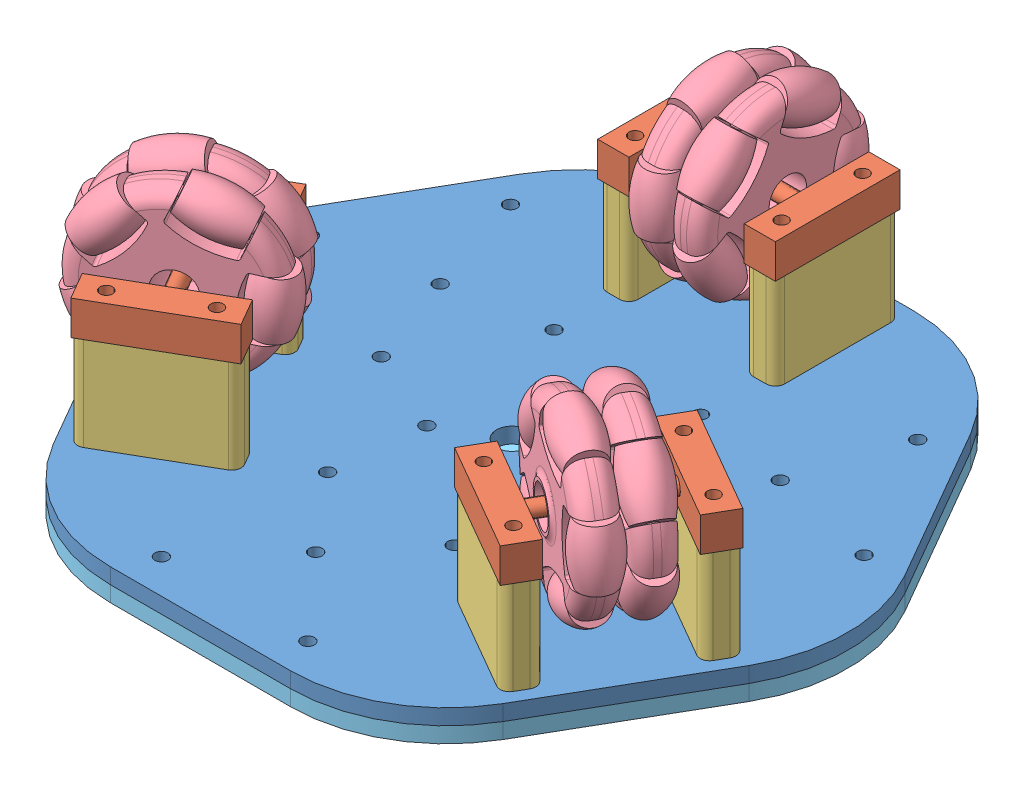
SolidWorks assembly 装配体-底座.SLDASM, configuration 默认 (file format 12000). Lengths in mm.
Overall size (280.94 77 286.6).
17 component instances, 5 part files, 12 mates.
Components (placement in the parent):
- 底盘-上层-1: 底盘-上层.SLDPRT [默认] at (-27.1025 -44.7578 215.4701) size (215.47 5 200)
- 装配体-支撑腿-1: 装配体-支撑腿.SLDASM [默认] at (-67.1097 -11.8387 183.0428) x (0.072827 0.996458 -0.042047) z (-0.862958 0.084094 0.498229) size (66.21 57 58.3)
  - 全向轮固定架-1: 全向轮固定架.SLDPRT [默认] at (-12.0465 -19.5864 36.6833) x (0 -1 0) z (-0.084094 0 0.996458) size (57 11 40)
  - 万向轮支撑腿-分体式-1: 万向轮支撑腿-分体式.SLDPRT [默认] at (-30.9792 -29.5864 35.0855) x (0 -1 0) z (-0.084094 0 0.996458) size (10 30 40)
  - 万向轮支撑腿-分体式-2: 万向轮支撑腿-分体式.SLDPRT [默认] at (-30.9792 -76.5864 35.0855) x (0 -1 0) z (-0.084094 0 0.996458) size (10 30 40)
  - 全向轮-网上找的模型58mm-1: 全向轮-网上找的模型58mm.SLDPRT [По умолчанию] at (2.7132 -35.5864 58) x (1 0 0) z (0 -1 0) size (58.3 58.3 27)
- 装配体-支撑腿-2: 装配体-支撑腿.SLDASM [默认] at (-35.1817 -11.8387 266.3309) x (-0.072827 0.996458 -0.042047) z (0.862958 0.084094 0.498229) size (66.21 57 58.3)
  - 全向轮固定架-1: 全向轮固定架.SLDPRT [默认] at (-12.0465 -19.5864 36.6833) x (0 -1 0) z (-0.084094 0 0.996458) size (57 11 40)
  - 万向轮支撑腿-分体式-1: 万向轮支撑腿-分体式.SLDPRT [默认] at (-30.9792 -29.5864 35.0855) x (0 -1 0) z (-0.084094 0 0.996458) size (10 30 40)
  - 万向轮支撑腿-分体式-2: 万向轮支撑腿-分体式.SLDPRT [默认] at (-30.9792 -76.5864 35.0855) x (0 -1 0) z (-0.084094 0 0.996458) size (10 30 40)
  - 全向轮-网上找的模型58mm-1: 全向轮-网上找的模型58mm.SLDPRT [По умолчанию] at (2.7132 -35.5864 58) x (1 0 0) z (0 -1 0) size (58.3 58.3 27)
- 装配体-支撑腿-3: 装配体-支撑腿.SLDASM [默认] at (-75.1889 -11.8387 81.9037) x (0 0.996458 -0.084094) z (0 0.084094 0.996458) size (66.21 57 58.3)
  - 全向轮固定架-1: 全向轮固定架.SLDPRT [默认] at (-12.0465 -19.5864 36.6833) x (0 -1 0) z (-0.084094 0 0.996458) size (57 11 40)
  - 万向轮支撑腿-分体式-1: 万向轮支撑腿-分体式.SLDPRT [默认] at (-30.9792 -29.5864 35.0855) x (0 -1 0) z (-0.084094 0 0.996458) size (10 30 40)
  - 万向轮支撑腿-分体式-2: 万向轮支撑腿-分体式.SLDPRT [默认] at (-30.9792 -76.5864 35.0855) x (0 -1 0) z (-0.084094 0 0.996458) size (10 30 40)
  - 全向轮-网上找的模型58mm-1: 全向轮-网上找的模型58mm.SLDPRT [По умолчанию] at (2.7132 -35.5864 58) x (1 0 0) z (0 -1 0) size (58.3 58.3 27)
- 底盘-下层-1: 底盘-下层.SLDPRT [默认] at (-27.1025 -49.7578 215.4701) x (-0.5 0 -0.866025) z (0.866025 0 -0.5) size (215.47 5 200)
Mates (geometry in assembly coordinates):
- 重合1: coincident anti-aligned: plane of 底盘-上层-1 through (-27.1025 -39.7578 215.4701) normal (0 1 0); plane of 装配体-支撑腿-1/万向轮支撑腿-分体式-2 through (-61.3499 -39.7578 268.1518) normal (0 -1 0)
- 重合2: coincident anti-aligned: plane of 底盘-上层-1 through (-27.1025 -39.7578 215.4701) normal (0 1 0); plane of 装配体-支撑腿-2/万向轮支撑腿-分体式-1 through (12.145 -39.7578 259.4915) normal (0 -1 0)
- 重合3: coincident anti-aligned: plane of 底盘-上层-1 through (-27.1025 -39.7578 215.4701) normal (0 1 0); plane of 装配体-支撑腿-3/万向轮支撑腿-分体式-2 through (1.3975 -39.7578 119.4701) normal (0 -1 0)
- 重合4: coincident anti-aligned: plane of 底盘-上层-1 through (-27.1025 -44.7578 215.4701) normal (0 -1 0); plane of 底盘-下层-1 through (-27.1025 -44.7578 215.4701) normal (0 1 0)
- 同心14: concentric aligned: cylinder of 底盘-上层-1 through (38.2238 -44.7578 280.3217) axis (0 1 0) radius 2.1; cylinder of 底盘-下层-1 through (38.2238 -49.7578 280.3217) axis (0 1 0) radius 4
- 同心15: concentric aligned: cylinder of 底盘-上层-1 through (61.7238 -44.7578 239.6185) axis (0 1 0) radius 2.1; cylinder of 底盘-下层-1 through (61.7238 -49.7578 239.6185) axis (0 1 0) radius 4
- 同心16: concentric anti-aligned: cylinder of 装配体-支撑腿-1/万向轮支撑腿-分体式-2 through (-92.4287 -9.7578 280.3217) axis (0 -1 0) radius 2.1; cylinder of 底盘-下层-1 through (-92.4287 -49.7578 280.3217) axis (0 1 0) radius 4
- 同心17: concentric anti-aligned: cylinder of 装配体-支撑腿-1/万向轮支撑腿-分体式-1 through (-115.9287 -9.7578 239.6185) axis (0 -1 0) radius 2.1; cylinder of 底盘-下层-1 through (-115.9287 -49.7578 239.6185) axis (0 1 0) radius 4
- 同心18: concentric anti-aligned: cylinder of 装配体-支撑腿-3/万向轮支撑腿-分体式-1 through (-50.6025 -9.7578 126.4701) axis (0 -1 0) radius 2.1; cylinder of 底盘-下层-1 through (-50.6025 -49.7578 126.4701) axis (0 1 0) radius 4
- 同心19: concentric anti-aligned: cylinder of 装配体-支撑腿-3/万向轮支撑腿-分体式-2 through (-3.6025 -9.7578 126.4701) axis (0 -1 0) radius 2.1; cylinder of 底盘-下层-1 through (-3.6025 -49.7578 126.4701) axis (0 1 0) radius 4
- 同心20: concentric anti-aligned: cylinder of 装配体-支撑腿-2/万向轮支撑腿-分体式-2 through (61.7238 -9.7578 239.6185) axis (0 -1 0) radius 2.1; cylinder of 底盘-下层-1 through (61.7238 -49.7578 239.6185) axis (0 1 0) radius 4
- 同心21: concentric anti-aligned: cylinder of 装配体-支撑腿-2/万向轮支撑腿-分体式-1 through (38.2238 -9.7578 280.3217) axis (0 -1 0) radius 2.1; cylinder of 底盘-下层-1 through (38.2238 -49.7578 280.3217) axis (0 1 0) radius 4
